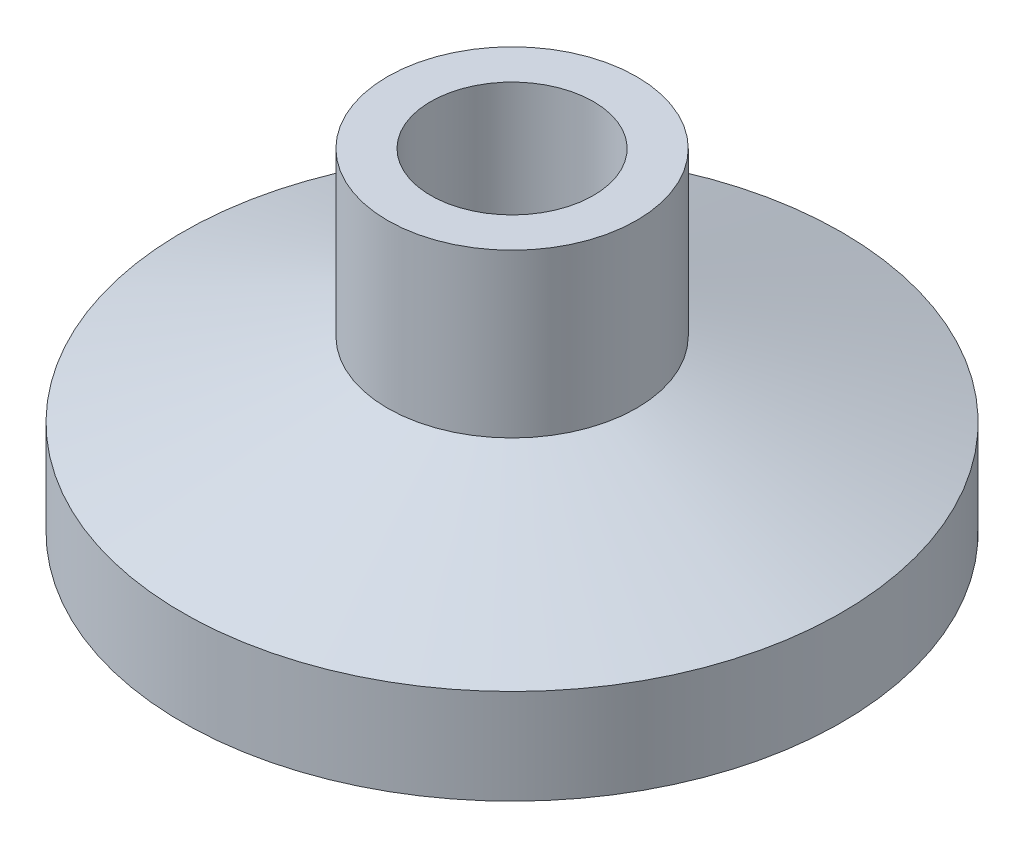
from build123d import *


with BuildPart() as part:
    # Sketch1 → Revolve1 (revolve)
    with BuildSketch(Plane.XY, mode=Mode.PRIVATE) as revolve1_sk:
        with BuildLine():
            Line((-3.1115, 0.889), (-3.1115, 12.7))
            Line((-3.1115, 12.7), (-4.7625, 12.7))
            Line((-4.7625, 12.7), (-4.7625, 6.484234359))
            Line((-4.7625, 6.484234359), (-12.5984, 3.6322))
            Line((-12.5984, 3.6322), (-12.5984, 0))
            Line((-12.5984, 0), (-10.922, 0))
            Line((-10.922, 0), (-10.922, 1.3208))
            ThreePointArc((-10.922, 1.3208), (-10.433686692, 2.040621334), (-9.584339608, 1.852998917))
            Line((-9.584339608, 1.852998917), (-8.60238726, 0.889))
            Line((-8.60238726, 0.889), (-3.1115, 0.889))
        make_face()
    revolve(revolve1_sk.sketch.rotate(Axis((0, 0, 0), (0, 1, 0)), 270), axis=Axis((0, 0, 0), (0, 1, 0)))


solid = part.part
